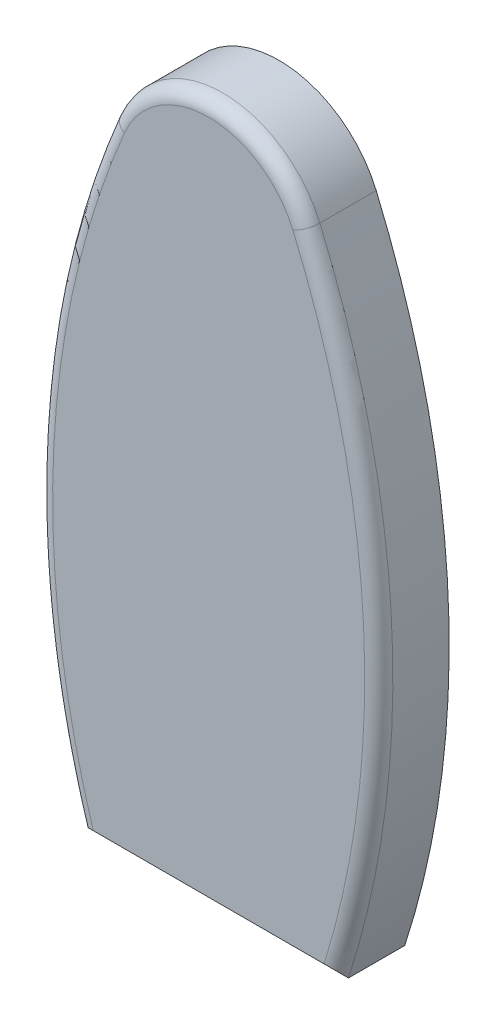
ISO-10303-21;
HEADER;
FILE_DESCRIPTION(('STEP AP214'),'2;1');
FILE_NAME('part.step','',(''),(''),'','','');
FILE_SCHEMA(('AUTOMOTIVE_DESIGN { 1 0 10303 214 1 1 1 1 }'));
ENDSEC;
DATA;
#1=APPLICATION_CONTEXT('core data for automotive mechanical design processes');
#2=APPLICATION_PROTOCOL_DEFINITION('international standard','automotive_design',2000,#1);
#3=PRODUCT_CONTEXT('',#1,'mechanical');
#4=PRODUCT('Part','Part','',(#3));
#5=PRODUCT_RELATED_PRODUCT_CATEGORY('part','',(#4));
#6=PRODUCT_DEFINITION_FORMATION('','',#4);
#7=PRODUCT_DEFINITION_CONTEXT('part definition',#1,'design');
#8=PRODUCT_DEFINITION('design','',#6,#7);
#9=PRODUCT_DEFINITION_SHAPE('','',#8);
#10=(LENGTH_UNIT() NAMED_UNIT(*) SI_UNIT(.MILLI.,.METRE.));
#11=(NAMED_UNIT(*) PLANE_ANGLE_UNIT() SI_UNIT($,.RADIAN.));
#12=(NAMED_UNIT(*) SI_UNIT($,.STERADIAN.) SOLID_ANGLE_UNIT());
#13=UNCERTAINTY_MEASURE_WITH_UNIT(LENGTH_MEASURE(1.E-05),#10,'distance_accuracy_value','');
#14=(GEOMETRIC_REPRESENTATION_CONTEXT(3) GLOBAL_UNCERTAINTY_ASSIGNED_CONTEXT((#13)) GLOBAL_UNIT_ASSIGNED_CONTEXT((#10,
#11,#12)) REPRESENTATION_CONTEXT('',''));
#15=CARTESIAN_POINT('',(0.,0.,0.));
#16=DIRECTION('',(0.,0.,1.));
#17=DIRECTION('',(1.,0.,0.));
#18=AXIS2_PLACEMENT_3D('',#15,#16,#17);
#19=CARTESIAN_POINT('',(0.,55.,-10.));
#20=DIRECTION('',(0.,0.,1.));
#21=DIRECTION('',(1.,0.,0.));
#22=AXIS2_PLACEMENT_3D('',#19,#20,#21);
#23=CYLINDRICAL_SURFACE('',#22,15.);
#24=DIRECTION('',(0.,0.,1.));
#25=VECTOR('',#24,1.);
#26=CARTESIAN_POINT('',(-13.8039198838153,60.8695652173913,-10.));
#27=LINE('',#26,#25);
#28=CARTESIAN_POINT('',(-13.8039198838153,60.8695652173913,-10.));
#29=VERTEX_POINT('',#28);
#30=CARTESIAN_POINT('',(-13.8039198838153,60.8695652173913,-2.));
#31=VERTEX_POINT('',#30);
#32=EDGE_CURVE('E180',#29,#31,#27,.T.);
#33=ORIENTED_EDGE('',*,*,#32,.T.);
#34=CARTESIAN_POINT('',(0.,55.,-2.));
#35=DIRECTION('',(0.,0.,1.));
#36=DIRECTION('',(1.,0.,0.));
#37=AXIS2_PLACEMENT_3D('',#34,#35,#36);
#38=CIRCLE('',#37,15.);
#39=CARTESIAN_POINT('',(13.8039198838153,60.8695652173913,-2.));
#40=VERTEX_POINT('',#39);
#41=EDGE_CURVE('E43',#31,#40,#38,.F.);
#42=ORIENTED_EDGE('',*,*,#41,.T.);
#43=DIRECTION('',(0.,0.,1.));
#44=VECTOR('',#43,1.);
#45=CARTESIAN_POINT('',(13.8039198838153,60.8695652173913,-10.));
#46=LINE('',#45,#44);
#47=CARTESIAN_POINT('',(13.8039198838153,60.8695652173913,-10.));
#48=VERTEX_POINT('',#47);
#49=EDGE_CURVE('E181',#48,#40,#46,.T.);
#50=ORIENTED_EDGE('',*,*,#49,.F.);
#51=CARTESIAN_POINT('',(0.,55.,-10.));
#52=DIRECTION('',(0.,0.,1.));
#53=DIRECTION('',(1.,0.,0.));
#54=AXIS2_PLACEMENT_3D('',#51,#52,#53);
#55=CIRCLE('',#54,15.);
#56=EDGE_CURVE('E168',#48,#29,#55,.T.);
#57=ORIENTED_EDGE('',*,*,#56,.T.);
#58=EDGE_LOOP('',(#33,#42,#50,#57));
#59=FACE_BOUND('',#58,.T.);
#60=ADVANCED_FACE('F33',(#59),#23,.T.);
#61=CARTESIAN_POINT('',(-105.830052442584,10.,-10.));
#62=DIRECTION('',(0.,0.,1.));
#63=DIRECTION('',(1.,0.,0.));
#64=AXIS2_PLACEMENT_3D('',#61,#62,#63);
#65=CYLINDRICAL_SURFACE('',#64,130.);
#66=ORIENTED_EDGE('',*,*,#49,.T.);
#67=CARTESIAN_POINT('',(-105.830052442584,10.,-2.));
#68=DIRECTION('',(0.,0.,1.));
#69=DIRECTION('',(1.,0.,0.));
#70=AXIS2_PLACEMENT_3D('',#67,#68,#69);
#71=CIRCLE('',#70,130.);
#72=CARTESIAN_POINT('',(17.8631163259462,-30.,-2.00000000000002));
#73=VERTEX_POINT('',#72);
#74=EDGE_CURVE('E203',#40,#73,#71,.F.);
#75=ORIENTED_EDGE('',*,*,#74,.T.);
#76=DIRECTION('',(0.,0.,1.));
#77=VECTOR('',#76,1.);
#78=CARTESIAN_POINT('',(17.8631163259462,-30.,-10.));
#79=LINE('',#78,#77);
#80=CARTESIAN_POINT('',(17.8631163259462,-30.,-10.));
#81=VERTEX_POINT('',#80);
#82=EDGE_CURVE('E185',#81,#73,#79,.T.);
#83=ORIENTED_EDGE('',*,*,#82,.F.);
#84=CARTESIAN_POINT('',(-105.830052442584,10.,-10.));
#85=DIRECTION('',(0.,0.,1.));
#86=DIRECTION('',(-1.,0.,0.));
#87=AXIS2_PLACEMENT_3D('',#84,#85,#86);
#88=CIRCLE('',#87,130.);
#89=EDGE_CURVE('E177',#81,#48,#88,.T.);
#90=ORIENTED_EDGE('',*,*,#89,.T.);
#91=EDGE_LOOP('',(#66,#75,#83,#90));
#92=FACE_BOUND('',#91,.T.);
#93=ADVANCED_FACE('F238',(#92),#65,.T.);
#94=CARTESIAN_POINT('',(-17.8631163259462,-30.,-10.));
#95=DIRECTION('',(0.,-1.,0.));
#96=DIRECTION('',(0.,0.,-1.));
#97=AXIS2_PLACEMENT_3D('',#94,#95,#96);
#98=PLANE('',#97);
#99=ORIENTED_EDGE('',*,*,#82,.T.);
#100=DIRECTION('',(-1.,0.,0.));
#101=VECTOR('',#100,1.);
#102=CARTESIAN_POINT('',(-17.8631163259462,-30.,-2.00000000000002));
#103=LINE('',#102,#101);
#104=CARTESIAN_POINT('',(-17.8631163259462,-29.9999999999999,-1.99999999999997));
#105=VERTEX_POINT('',#104);
#106=EDGE_CURVE('E193',#73,#105,#103,.T.);
#107=ORIENTED_EDGE('',*,*,#106,.T.);
#108=DIRECTION('',(0.,0.,1.));
#109=VECTOR('',#108,1.);
#110=CARTESIAN_POINT('',(-17.8631163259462,-29.9999999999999,-10.));
#111=LINE('',#110,#109);
#112=CARTESIAN_POINT('',(-17.8631163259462,-29.9999999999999,-10.));
#113=VERTEX_POINT('',#112);
#114=EDGE_CURVE('E188',#113,#105,#111,.T.);
#115=ORIENTED_EDGE('',*,*,#114,.F.);
#116=DIRECTION('',(1.,0.,0.));
#117=VECTOR('',#116,1.);
#118=CARTESIAN_POINT('',(-17.8631163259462,-30.,-10.));
#119=LINE('',#118,#117);
#120=EDGE_CURVE('E174',#113,#81,#119,.T.);
#121=ORIENTED_EDGE('',*,*,#120,.T.);
#122=EDGE_LOOP('',(#99,#107,#115,#121));
#123=FACE_BOUND('',#122,.T.);
#124=ADVANCED_FACE('F243',(#123),#98,.T.);
#125=CARTESIAN_POINT('',(105.830052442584,10.,-10.));
#126=DIRECTION('',(0.,0.,1.));
#127=DIRECTION('',(1.,0.,0.));
#128=AXIS2_PLACEMENT_3D('',#125,#126,#127);
#129=CYLINDRICAL_SURFACE('',#128,130.);
#130=ORIENTED_EDGE('',*,*,#114,.T.);
#131=CARTESIAN_POINT('',(105.830052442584,10.,-2.));
#132=DIRECTION('',(0.,0.,1.));
#133=DIRECTION('',(1.,0.,0.));
#134=AXIS2_PLACEMENT_3D('',#131,#132,#133);
#135=CIRCLE('',#134,130.);
#136=EDGE_CURVE('E11',#105,#31,#135,.F.);
#137=ORIENTED_EDGE('',*,*,#136,.T.);
#138=ORIENTED_EDGE('',*,*,#32,.F.);
#139=CARTESIAN_POINT('',(105.830052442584,10.,-10.));
#140=DIRECTION('',(0.,0.,1.));
#141=DIRECTION('',(1.,0.,0.));
#142=AXIS2_PLACEMENT_3D('',#139,#140,#141);
#143=CIRCLE('',#142,130.);
#144=EDGE_CURVE('E171',#29,#113,#143,.T.);
#145=ORIENTED_EDGE('',*,*,#144,.T.);
#146=EDGE_LOOP('',(#130,#137,#138,#145));
#147=FACE_BOUND('',#146,.T.);
#148=ADVANCED_FACE('F262',(#147),#129,.T.);
#149=CARTESIAN_POINT('',(0.,55.,-10.));
#150=DIRECTION('',(0.,0.,1.));
#151=DIRECTION('',(1.,0.,0.));
#152=AXIS2_PLACEMENT_3D('',#149,#150,#151);
#153=PLANE('',#152);
#154=CARTESIAN_POINT('',(-105.830052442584,10.,-10.));
#155=DIRECTION('',(0.,0.,1.));
#156=DIRECTION('',(1.,0.,0.));
#157=AXIS2_PLACEMENT_3D('',#154,#155,#156);
#158=CIRCLE('',#157,128.);
#159=CARTESIAN_POINT('',(16.3992402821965,-28.,-10.));
#160=VERTEX_POINT('',#159);
#161=CARTESIAN_POINT('',(11.9633972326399,60.0869565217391,-10.));
#162=VERTEX_POINT('',#161);
#163=EDGE_CURVE('E144',#160,#162,#158,.T.);
#164=ORIENTED_EDGE('',*,*,#163,.T.);
#165=CARTESIAN_POINT('',(0.,55.,-10.));
#166=DIRECTION('',(0.,0.,1.));
#167=DIRECTION('',(1.,0.,0.));
#168=AXIS2_PLACEMENT_3D('',#165,#166,#167);
#169=CIRCLE('',#168,13.);
#170=CARTESIAN_POINT('',(-11.9633972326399,60.0869565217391,-10.));
#171=VERTEX_POINT('',#170);
#172=EDGE_CURVE('E164',#162,#171,#169,.T.);
#173=ORIENTED_EDGE('',*,*,#172,.T.);
#174=CARTESIAN_POINT('',(105.830052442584,10.,-10.));
#175=DIRECTION('',(0.,0.,1.));
#176=DIRECTION('',(1.,0.,0.));
#177=AXIS2_PLACEMENT_3D('',#174,#175,#176);
#178=CIRCLE('',#177,128.);
#179=CARTESIAN_POINT('',(-16.3992402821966,-28.,-10.));
#180=VERTEX_POINT('',#179);
#181=EDGE_CURVE('E141',#171,#180,#178,.T.);
#182=ORIENTED_EDGE('',*,*,#181,.T.);
#183=DIRECTION('',(1.,0.,0.));
#184=VECTOR('',#183,1.);
#185=CARTESIAN_POINT('',(0.,-28.,-10.));
#186=LINE('',#185,#184);
#187=EDGE_CURVE('E51',#180,#160,#186,.T.);
#188=ORIENTED_EDGE('',*,*,#187,.T.);
#189=EDGE_LOOP('',(#164,#173,#182,#188));
#190=FACE_BOUND('',#189,.T.);
#191=ORIENTED_EDGE('',*,*,#56,.F.);
#192=ORIENTED_EDGE('',*,*,#89,.F.);
#193=ORIENTED_EDGE('',*,*,#120,.F.);
#194=ORIENTED_EDGE('',*,*,#144,.F.);
#195=EDGE_LOOP('',(#191,#192,#193,#194));
#196=FACE_BOUND('',#195,.T.);
#197=ADVANCED_FACE('F264',(#190,#196),#153,.F.);
#198=CARTESIAN_POINT('',(0.,55.,0.));
#199=DIRECTION('',(0.,0.,1.));
#200=DIRECTION('',(1.,0.,0.));
#201=AXIS2_PLACEMENT_3D('',#198,#199,#200);
#202=PLANE('',#201);
#203=DIRECTION('',(1.,0.,0.));
#204=VECTOR('',#203,1.);
#205=CARTESIAN_POINT('',(0.,-28.,0.));
#206=LINE('',#205,#204);
#207=CARTESIAN_POINT('',(-16.3992402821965,-28.,0.));
#208=VERTEX_POINT('',#207);
#209=CARTESIAN_POINT('',(16.3992402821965,-28.,0.));
#210=VERTEX_POINT('',#209);
#211=EDGE_CURVE('E184',#208,#210,#206,.T.);
#212=ORIENTED_EDGE('',*,*,#211,.T.);
#213=CARTESIAN_POINT('',(-105.830052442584,10.,0.));
#214=DIRECTION('',(0.,0.,1.));
#215=DIRECTION('',(1.,0.,0.));
#216=AXIS2_PLACEMENT_3D('',#213,#214,#215);
#217=CIRCLE('',#216,128.);
#218=CARTESIAN_POINT('',(11.9633972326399,60.0869565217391,0.));
#219=VERTEX_POINT('',#218);
#220=EDGE_CURVE('E200',#210,#219,#217,.T.);
#221=ORIENTED_EDGE('',*,*,#220,.T.);
#222=CARTESIAN_POINT('',(0.,55.,0.));
#223=DIRECTION('',(0.,0.,1.));
#224=DIRECTION('',(1.,0.,0.));
#225=AXIS2_PLACEMENT_3D('',#222,#223,#224);
#226=CIRCLE('',#225,13.);
#227=CARTESIAN_POINT('',(-11.9633972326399,60.0869565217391,0.));
#228=VERTEX_POINT('',#227);
#229=EDGE_CURVE('E198',#219,#228,#226,.T.);
#230=ORIENTED_EDGE('',*,*,#229,.T.);
#231=CARTESIAN_POINT('',(105.830052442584,10.,0.));
#232=DIRECTION('',(0.,0.,1.));
#233=DIRECTION('',(1.,0.,0.));
#234=AXIS2_PLACEMENT_3D('',#231,#232,#233);
#235=CIRCLE('',#234,128.);
#236=EDGE_CURVE('E196',#228,#208,#235,.T.);
#237=ORIENTED_EDGE('',*,*,#236,.T.);
#238=EDGE_LOOP('',(#212,#221,#230,#237));
#239=FACE_BOUND('',#238,.T.);
#240=ADVANCED_FACE('F221',(#239),#202,.T.);
#241=CARTESIAN_POINT('',(0.,-28.,0.));
#242=DIRECTION('',(0.,0.707106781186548,-0.707106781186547));
#243=DIRECTION('',(0.,0.707106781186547,0.707106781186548));
#244=AXIS2_PLACEMENT_3D('',#241,#242,#243);
#245=PLANE('',#244);
#246=ORIENTED_EDGE('',*,*,#106,.F.);
#247=CARTESIAN_POINT('',(17.8631163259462,-30.,-2.));
#248=CARTESIAN_POINT('',(17.8817998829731,-29.9421922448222,-1.94219224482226));
#249=CARTESIAN_POINT('',(17.8979606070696,-29.8839627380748,-1.88396273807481));
#250=CARTESIAN_POINT('',(17.9248872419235,-29.7668117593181,-1.76681175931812));
#251=CARTESIAN_POINT('',(17.9356464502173,-29.7078895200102,-1.70788952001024));
#252=CARTESIAN_POINT('',(17.9514540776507,-29.5890379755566,-1.58903797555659));
#253=CARTESIAN_POINT('',(17.9564423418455,-29.5291045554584,-1.52910455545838));
#254=CARTESIAN_POINT('',(17.9600252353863,-29.4091743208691,-1.40917432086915));
#255=CARTESIAN_POINT('',(17.9586230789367,-29.3491775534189,-1.34917755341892));
#256=CARTESIAN_POINT('',(17.9462196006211,-29.1968310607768,-1.19683106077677));
#257=CARTESIAN_POINT('',(17.9304100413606,-29.1046415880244,-1.10464158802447));
#258=CARTESIAN_POINT('',(17.8797383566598,-28.923096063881,-0.923096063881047));
#259=CARTESIAN_POINT('',(17.8449403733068,-28.8337315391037,-0.833731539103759));
#260=CARTESIAN_POINT('',(17.7641193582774,-28.6808636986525,-0.680863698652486));
#261=CARTESIAN_POINT('',(17.7225945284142,-28.61618256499,-0.616182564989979));
#262=CARTESIAN_POINT('',(17.6254543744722,-28.4922785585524,-0.492278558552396));
#263=CARTESIAN_POINT('',(17.5698525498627,-28.4330505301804,-0.433050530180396));
#264=CARTESIAN_POINT('',(17.4557787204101,-28.3330507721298,-0.333050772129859));
#265=CARTESIAN_POINT('',(17.3997480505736,-28.2908928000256,-0.290892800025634));
#266=CARTESIAN_POINT('',(17.2785413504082,-28.2137685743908,-0.213768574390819));
#267=CARTESIAN_POINT('',(17.2133748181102,-28.1787949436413,-0.178794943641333));
#268=CARTESIAN_POINT('',(17.0749761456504,-28.1174518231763,-0.11745182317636));
#269=CARTESIAN_POINT('',(17.0017112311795,-28.0911191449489,-0.0911191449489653));
#270=CARTESIAN_POINT('',(16.8495748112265,-28.0482805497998,-0.0482805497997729));
#271=CARTESIAN_POINT('',(16.7707003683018,-28.0317798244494,-0.031779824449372));
#272=CARTESIAN_POINT('',(16.6425069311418,-28.0134160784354,-0.0134160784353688));
#273=CARTESIAN_POINT('',(16.5940502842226,-28.0083353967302,-0.00833539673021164));
#274=CARTESIAN_POINT('',(16.4968080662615,-28.0016292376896,-0.00162923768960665));
#275=CARTESIAN_POINT('',(16.4480239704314,-27.9999931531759,6.84682404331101E-06));
#276=CARTESIAN_POINT('',(16.3992402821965,-28.,0.));
#277=B_SPLINE_CURVE_WITH_KNOTS('',3,(#247,#248,#249,#250,#251,#252,#253,#254,#255,#256,#257,
#258,#259,#260,#261,#262,#263,#264,#265,#266,#267,#268,#269,#270,#271,#272,#273,#274,#275,#276),
.UNSPECIFIED.,.F.,.F.,(4,2,2,2,2,2,2,2,2,2,2,2,2,2,4),(0.,0.251568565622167,0.503448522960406,
0.757931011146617,1.01228551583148,1.40504793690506,1.79649176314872,2.09682024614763,
2.39686180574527,2.6413013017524,2.88548852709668,3.13070290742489,3.37604665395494,
3.52278241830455,3.66906566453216),.UNSPECIFIED.);
#278=EDGE_CURVE('E211',#73,#210,#277,.T.);
#279=ORIENTED_EDGE('',*,*,#278,.T.);
#280=ORIENTED_EDGE('',*,*,#211,.F.);
#281=CARTESIAN_POINT('',(-16.3992402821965,-28.,0.));
#282=CARTESIAN_POINT('',(-16.4388328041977,-27.9999991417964,8.58203535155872E-07));
#283=CARTESIAN_POINT('',(-16.4784167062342,-28.0010734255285,-0.00107342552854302));
#284=CARTESIAN_POINT('',(-16.557355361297,-28.0054608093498,-0.00546080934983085));
#285=CARTESIAN_POINT('',(-16.5967099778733,-28.0087751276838,-0.00877512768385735));
#286=CARTESIAN_POINT('',(-16.7139062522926,-28.0221932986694,-0.0221932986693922));
#287=CARTESIAN_POINT('',(-16.791024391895,-28.035771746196,-0.035771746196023));
#288=CARTESIAN_POINT('',(-16.940954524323,-28.0723083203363,-0.0723083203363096));
#289=CARTESIAN_POINT('',(-17.0137511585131,-28.0952978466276,-0.0952978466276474));
#290=CARTESIAN_POINT('',(-17.1524620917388,-28.1498942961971,-0.149894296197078));
#291=CARTESIAN_POINT('',(-17.2183826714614,-28.1814932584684,-0.181493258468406));
#292=CARTESIAN_POINT('',(-17.3398501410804,-28.2508327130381,-0.250832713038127));
#293=CARTESIAN_POINT('',(-17.3956627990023,-28.2883425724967,-0.288342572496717));
#294=CARTESIAN_POINT('',(-17.498857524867,-28.3687790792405,-0.368779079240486));
#295=CARTESIAN_POINT('',(-17.5462310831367,-28.411711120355,-0.411711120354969));
#296=CARTESIAN_POINT('',(-17.6514282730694,-28.5213899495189,-0.521389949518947));
#297=CARTESIAN_POINT('',(-17.7047092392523,-28.5903173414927,-0.590317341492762));
#298=CARTESIAN_POINT('',(-17.7949005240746,-28.7333138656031,-0.733313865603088));
#299=CARTESIAN_POINT('',(-17.8317785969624,-28.8073927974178,-0.807392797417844));
#300=CARTESIAN_POINT('',(-17.9031933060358,-28.9897866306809,-0.989786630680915));
#301=CARTESIAN_POINT('',(-17.9303803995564,-29.0995292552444,-1.09952925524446));
#302=CARTESIAN_POINT('',(-17.9600788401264,-29.3207063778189,-1.32070637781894));
#303=CARTESIAN_POINT('',(-17.9625334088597,-29.4321441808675,-1.43214418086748));
#304=CARTESIAN_POINT('',(-17.9487700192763,-29.6203068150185,-1.62030681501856));
#305=CARTESIAN_POINT('',(-17.9380101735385,-29.6972693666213,-1.69726936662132));
#306=CARTESIAN_POINT('',(-17.9072285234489,-29.8497182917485,-1.84971829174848));
#307=CARTESIAN_POINT('',(-17.8872723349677,-29.9252112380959,-1.92521123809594));
#308=CARTESIAN_POINT('',(-17.8631163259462,-30.,-2.));
#309=B_SPLINE_CURVE_WITH_KNOTS('',3,(#281,#282,#283,#284,#285,#286,#287,#288,#289,#290,#291,
#292,#293,#294,#295,#296,#297,#298,#299,#300,#301,#302,#303,#304,#305,#306,#307,#308),
.UNSPECIFIED.,.F.,.F.,(4,2,2,2,2,2,2,2,2,2,2,2,2,4),(0.,0.118724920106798,0.237514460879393,
0.474666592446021,0.712616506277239,0.950347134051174,1.1804195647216,1.41072269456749,
1.74213162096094,2.07418920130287,2.54431769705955,3.01552521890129,3.34325234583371,
3.66867650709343),.UNSPECIFIED.);
#310=EDGE_CURVE('E205',#208,#105,#309,.T.);
#311=ORIENTED_EDGE('',*,*,#310,.T.);
#312=EDGE_LOOP('',(#246,#279,#280,#311));
#313=FACE_BOUND('',#312,.T.);
#314=ADVANCED_FACE('F217',(#313),#245,.F.);
#315=CARTESIAN_POINT('',(105.830052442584,10.,-2.));
#316=DIRECTION('',(0.,0.,1.));
#317=DIRECTION('',(1.,0.,0.));
#318=AXIS2_PLACEMENT_3D('',#315,#316,#317);
#319=TOROIDAL_SURFACE('',#318,128.,2.);
#320=ORIENTED_EDGE('',*,*,#310,.F.);
#321=ORIENTED_EDGE('',*,*,#236,.F.);
#322=CARTESIAN_POINT('',(-11.9633972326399,60.0869565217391,-2.));
#323=DIRECTION('',(0.391304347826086,0.920261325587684,0.));
#324=DIRECTION('',(-0.920261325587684,0.391304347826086,0.));
#325=AXIS2_PLACEMENT_3D('',#322,#323,#324);
#326=CIRCLE('',#325,2.);
#327=EDGE_CURVE('E38',#31,#228,#326,.T.);
#328=ORIENTED_EDGE('',*,*,#327,.F.);
#329=ORIENTED_EDGE('',*,*,#136,.F.);
#330=EDGE_LOOP('',(#320,#321,#328,#329));
#331=FACE_BOUND('',#330,.T.);
#332=ADVANCED_FACE('F35',(#331),#319,.T.);
#333=CARTESIAN_POINT('',(0.,55.,-2.));
#334=DIRECTION('',(0.,0.,1.));
#335=DIRECTION('',(1.,0.,0.));
#336=AXIS2_PLACEMENT_3D('',#333,#334,#335);
#337=TOROIDAL_SURFACE('',#336,13.,2.);
#338=ORIENTED_EDGE('',*,*,#327,.T.);
#339=ORIENTED_EDGE('',*,*,#229,.F.);
#340=CARTESIAN_POINT('',(11.9633972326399,60.0869565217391,-2.));
#341=DIRECTION('',(0.391304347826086,-0.920261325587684,0.));
#342=DIRECTION('',(0.920261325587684,0.391304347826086,0.));
#343=AXIS2_PLACEMENT_3D('',#340,#341,#342);
#344=CIRCLE('',#343,2.);
#345=EDGE_CURVE('E163',#40,#219,#344,.T.);
#346=ORIENTED_EDGE('',*,*,#345,.F.);
#347=ORIENTED_EDGE('',*,*,#41,.F.);
#348=EDGE_LOOP('',(#338,#339,#346,#347));
#349=FACE_BOUND('',#348,.T.);
#350=ADVANCED_FACE('F228',(#349),#337,.T.);
#351=CARTESIAN_POINT('',(-105.830052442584,10.,-2.));
#352=DIRECTION('',(0.,0.,1.));
#353=DIRECTION('',(1.,0.,0.));
#354=AXIS2_PLACEMENT_3D('',#351,#352,#353);
#355=TOROIDAL_SURFACE('',#354,128.,2.);
#356=ORIENTED_EDGE('',*,*,#278,.F.);
#357=ORIENTED_EDGE('',*,*,#74,.F.);
#358=ORIENTED_EDGE('',*,*,#345,.T.);
#359=ORIENTED_EDGE('',*,*,#220,.F.);
#360=EDGE_LOOP('',(#356,#357,#358,#359));
#361=FACE_BOUND('',#360,.T.);
#362=ADVANCED_FACE('F224',(#361),#355,.T.);
#363=CARTESIAN_POINT('',(0.,55.,-10.));
#364=DIRECTION('',(0.,0.,1.));
#365=DIRECTION('',(1.,0.,0.));
#366=AXIS2_PLACEMENT_3D('',#363,#364,#365);
#367=CYLINDRICAL_SURFACE('',#366,13.);
#368=DIRECTION('',(0.,0.,1.));
#369=VECTOR('',#368,1.);
#370=CARTESIAN_POINT('',(-11.9633972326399,60.0869565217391,-10.));
#371=LINE('',#370,#369);
#372=CARTESIAN_POINT('',(-11.9633972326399,60.0869565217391,-2.));
#373=VERTEX_POINT('',#372);
#374=EDGE_CURVE('E124',#171,#373,#371,.T.);
#375=ORIENTED_EDGE('',*,*,#374,.F.);
#376=ORIENTED_EDGE('',*,*,#172,.F.);
#377=DIRECTION('',(0.,0.,1.));
#378=VECTOR('',#377,1.);
#379=CARTESIAN_POINT('',(11.9633972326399,60.0869565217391,-10.));
#380=LINE('',#379,#378);
#381=CARTESIAN_POINT('',(11.9633972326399,60.0869565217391,-2.));
#382=VERTEX_POINT('',#381);
#383=EDGE_CURVE('E126',#162,#382,#380,.T.);
#384=ORIENTED_EDGE('',*,*,#383,.T.);
#385=CARTESIAN_POINT('',(0.,55.,-2.));
#386=DIRECTION('',(0.,0.,1.));
#387=DIRECTION('',(1.,0.,0.));
#388=AXIS2_PLACEMENT_3D('',#385,#386,#387);
#389=CIRCLE('',#388,13.);
#390=EDGE_CURVE('E119',#382,#373,#389,.T.);
#391=ORIENTED_EDGE('',*,*,#390,.T.);
#392=EDGE_LOOP('',(#375,#376,#384,#391));
#393=FACE_BOUND('',#392,.T.);
#394=ADVANCED_FACE('F121',(#393),#367,.F.);
#395=CARTESIAN_POINT('',(-105.830052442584,10.,-10.));
#396=DIRECTION('',(0.,0.,1.));
#397=DIRECTION('',(1.,0.,0.));
#398=AXIS2_PLACEMENT_3D('',#395,#396,#397);
#399=CYLINDRICAL_SURFACE('',#398,128.);
#400=ORIENTED_EDGE('',*,*,#383,.F.);
#401=ORIENTED_EDGE('',*,*,#163,.F.);
#402=DIRECTION('',(0.,0.,1.));
#403=VECTOR('',#402,1.);
#404=CARTESIAN_POINT('',(16.3992402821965,-28.,-10.));
#405=LINE('',#404,#403);
#406=CARTESIAN_POINT('',(16.3992402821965,-28.,-2.82842712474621));
#407=VERTEX_POINT('',#406);
#408=EDGE_CURVE('E146',#160,#407,#405,.T.);
#409=ORIENTED_EDGE('',*,*,#408,.T.);
#410=CARTESIAN_POINT('',(-105.830052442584,10.,35.1715728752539));
#411=DIRECTION('',(0.,0.707106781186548,-0.707106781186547));
#412=DIRECTION('',(0.,0.707106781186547,0.707106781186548));
#413=AXIS2_PLACEMENT_3D('',#410,#411,#412);
#414=ELLIPSE('',#413,181.019335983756,128.);
#415=CARTESIAN_POINT('',(16.6537186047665,-27.1715728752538,-2.));
#416=VERTEX_POINT('',#415);
#417=EDGE_CURVE('E153',#407,#416,#414,.F.);
#418=ORIENTED_EDGE('',*,*,#417,.T.);
#419=CARTESIAN_POINT('',(-105.830052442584,10.,-2.));
#420=DIRECTION('',(0.,0.,1.));
#421=DIRECTION('',(1.,0.,0.));
#422=AXIS2_PLACEMENT_3D('',#419,#420,#421);
#423=CIRCLE('',#422,128.);
#424=EDGE_CURVE('E128',#382,#416,#423,.F.);
#425=ORIENTED_EDGE('',*,*,#424,.F.);
#426=EDGE_LOOP('',(#400,#401,#409,#418,#425));
#427=FACE_BOUND('',#426,.T.);
#428=ADVANCED_FACE('F328',(#427),#399,.F.);
#429=CARTESIAN_POINT('',(-17.8631163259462,-28.,-10.));
#430=DIRECTION('',(0.,-1.,0.));
#431=DIRECTION('',(0.,0.,-1.));
#432=AXIS2_PLACEMENT_3D('',#429,#430,#431);
#433=PLANE('',#432);
#434=ORIENTED_EDGE('',*,*,#408,.F.);
#435=ORIENTED_EDGE('',*,*,#187,.F.);
#436=DIRECTION('',(0.,0.,1.));
#437=VECTOR('',#436,1.);
#438=CARTESIAN_POINT('',(-16.3992402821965,-28.,-10.));
#439=LINE('',#438,#437);
#440=CARTESIAN_POINT('',(-16.3992402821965,-28.,-2.82842712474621));
#441=VERTEX_POINT('',#440);
#442=EDGE_CURVE('E143',#180,#441,#439,.T.);
#443=ORIENTED_EDGE('',*,*,#442,.T.);
#444=DIRECTION('',(1.,0.,0.));
#445=VECTOR('',#444,1.);
#446=CARTESIAN_POINT('',(-17.8631163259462,-28.,-2.82842712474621));
#447=LINE('',#446,#445);
#448=EDGE_CURVE('E137',#407,#441,#447,.F.);
#449=ORIENTED_EDGE('',*,*,#448,.F.);
#450=EDGE_LOOP('',(#434,#435,#443,#449));
#451=FACE_BOUND('',#450,.T.);
#452=ADVANCED_FACE('F337',(#451),#433,.F.);
#453=CARTESIAN_POINT('',(105.830052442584,10.,-10.));
#454=DIRECTION('',(0.,0.,1.));
#455=DIRECTION('',(1.,0.,0.));
#456=AXIS2_PLACEMENT_3D('',#453,#454,#455);
#457=CYLINDRICAL_SURFACE('',#456,128.);
#458=ORIENTED_EDGE('',*,*,#442,.F.);
#459=ORIENTED_EDGE('',*,*,#181,.F.);
#460=ORIENTED_EDGE('',*,*,#374,.T.);
#461=CARTESIAN_POINT('',(105.830052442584,10.,-2.));
#462=DIRECTION('',(0.,0.,1.));
#463=DIRECTION('',(1.,0.,0.));
#464=AXIS2_PLACEMENT_3D('',#461,#462,#463);
#465=CIRCLE('',#464,128.);
#466=CARTESIAN_POINT('',(-16.6537186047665,-27.1715728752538,-2.));
#467=VERTEX_POINT('',#466);
#468=EDGE_CURVE('E129',#373,#467,#465,.T.);
#469=ORIENTED_EDGE('',*,*,#468,.T.);
#470=CARTESIAN_POINT('',(105.830052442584,10.,35.1715728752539));
#471=DIRECTION('',(0.,0.707106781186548,-0.707106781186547));
#472=DIRECTION('',(0.,0.707106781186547,0.707106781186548));
#473=AXIS2_PLACEMENT_3D('',#470,#471,#472);
#474=ELLIPSE('',#473,181.019335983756,128.);
#475=EDGE_CURVE('E161',#441,#467,#474,.T.);
#476=ORIENTED_EDGE('',*,*,#475,.F.);
#477=EDGE_LOOP('',(#458,#459,#460,#469,#476));
#478=FACE_BOUND('',#477,.T.);
#479=ADVANCED_FACE('F139',(#478),#457,.F.);
#480=CARTESIAN_POINT('',(0.,55.,-2.));
#481=DIRECTION('',(0.,0.,1.));
#482=DIRECTION('',(1.,0.,0.));
#483=AXIS2_PLACEMENT_3D('',#480,#481,#482);
#484=PLANE('',#483);
#485=DIRECTION('',(-1.,0.,0.));
#486=VECTOR('',#485,1.);
#487=CARTESIAN_POINT('',(0.,-27.1715728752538,-2.));
#488=LINE('',#487,#486);
#489=EDGE_CURVE('E134',#467,#416,#488,.F.);
#490=ORIENTED_EDGE('',*,*,#489,.F.);
#491=ORIENTED_EDGE('',*,*,#468,.F.);
#492=ORIENTED_EDGE('',*,*,#390,.F.);
#493=ORIENTED_EDGE('',*,*,#424,.T.);
#494=EDGE_LOOP('',(#490,#491,#492,#493));
#495=FACE_BOUND('',#494,.T.);
#496=ADVANCED_FACE('F132',(#495),#484,.F.);
#497=CARTESIAN_POINT('',(0.,-26.5857864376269,-1.41421356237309));
#498=DIRECTION('',(0.,0.707106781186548,-0.707106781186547));
#499=DIRECTION('',(0.,0.707106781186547,0.707106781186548));
#500=AXIS2_PLACEMENT_3D('',#497,#498,#499);
#501=PLANE('',#500);
#502=ORIENTED_EDGE('',*,*,#448,.T.);
#503=ORIENTED_EDGE('',*,*,#475,.T.);
#504=ORIENTED_EDGE('',*,*,#489,.T.);
#505=ORIENTED_EDGE('',*,*,#417,.F.);
#506=EDGE_LOOP('',(#502,#503,#504,#505));
#507=FACE_BOUND('',#506,.T.);
#508=ADVANCED_FACE('F275',(#507),#501,.T.);
#509=CLOSED_SHELL('',(#60,#93,#124,#148,#197,#240,#314,#332,#350,#362,#394,#428,#452,#479,#496,#508));
#510=MANIFOLD_SOLID_BREP('B2',#509);
#511=ADVANCED_BREP_SHAPE_REPRESENTATION('',(#18,#510),#14);
#512=SHAPE_DEFINITION_REPRESENTATION(#9,#511);
ENDSEC;
END-ISO-10303-21;
